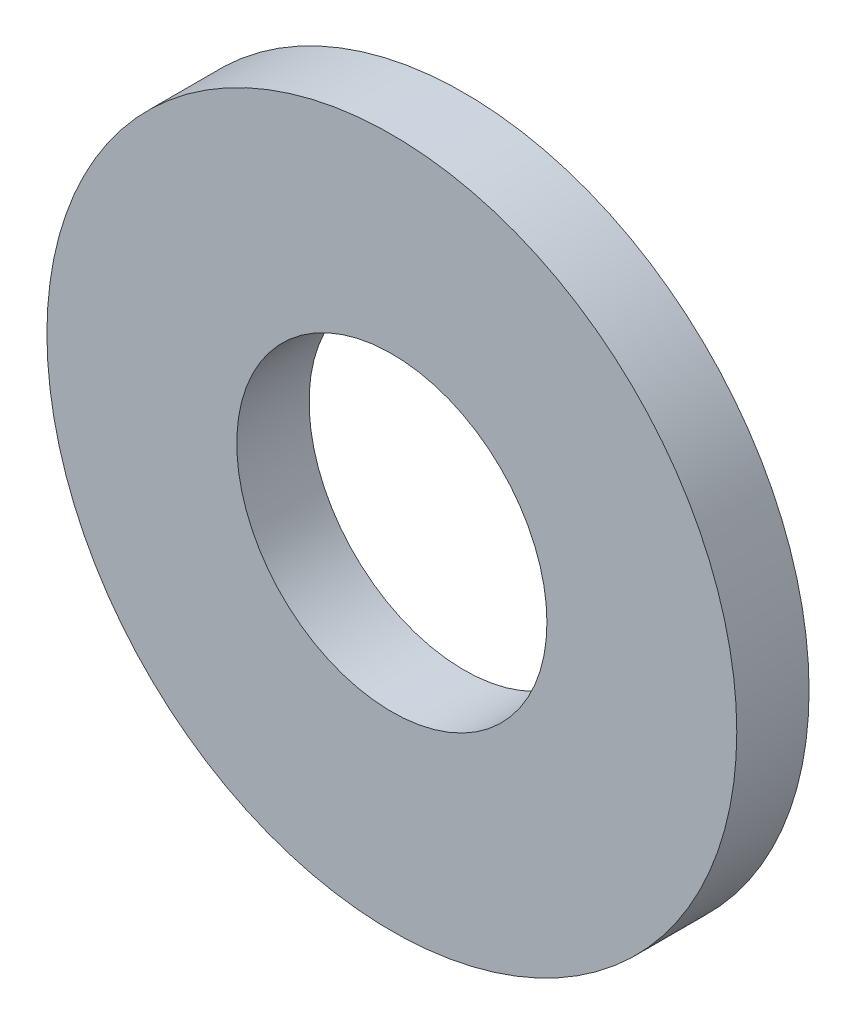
ISO-10303-21;
HEADER;
FILE_DESCRIPTION(('STEP AP214'),'2;1');
FILE_NAME('part.step','',(''),(''),'','','');
FILE_SCHEMA(('AUTOMOTIVE_DESIGN { 1 0 10303 214 1 1 1 1 }'));
ENDSEC;
DATA;
#1=APPLICATION_CONTEXT('core data for automotive mechanical design processes');
#2=APPLICATION_PROTOCOL_DEFINITION('international standard','automotive_design',2000,#1);
#3=PRODUCT_CONTEXT('',#1,'mechanical');
#4=PRODUCT('Part','Part','',(#3));
#5=PRODUCT_RELATED_PRODUCT_CATEGORY('part','',(#4));
#6=PRODUCT_DEFINITION_FORMATION('','',#4);
#7=PRODUCT_DEFINITION_CONTEXT('part definition',#1,'design');
#8=PRODUCT_DEFINITION('design','',#6,#7);
#9=PRODUCT_DEFINITION_SHAPE('','',#8);
#10=(LENGTH_UNIT() NAMED_UNIT(*) SI_UNIT(.MILLI.,.METRE.));
#11=(NAMED_UNIT(*) PLANE_ANGLE_UNIT() SI_UNIT($,.RADIAN.));
#12=(NAMED_UNIT(*) SI_UNIT($,.STERADIAN.) SOLID_ANGLE_UNIT());
#13=UNCERTAINTY_MEASURE_WITH_UNIT(LENGTH_MEASURE(1.E-05),#10,'distance_accuracy_value','');
#14=(GEOMETRIC_REPRESENTATION_CONTEXT(3) GLOBAL_UNCERTAINTY_ASSIGNED_CONTEXT((#13)) GLOBAL_UNIT_ASSIGNED_CONTEXT((#10,
#11,#12)) REPRESENTATION_CONTEXT('',''));
#15=CARTESIAN_POINT('',(0.,0.,0.));
#16=DIRECTION('',(0.,0.,1.));
#17=DIRECTION('',(1.,0.,0.));
#18=AXIS2_PLACEMENT_3D('',#15,#16,#17);
#19=CARTESIAN_POINT('',(0.,0.,0.83185));
#20=DIRECTION('',(0.,0.,1.));
#21=DIRECTION('',(1.,0.,0.));
#22=AXIS2_PLACEMENT_3D('',#19,#20,#21);
#23=PLANE('',#22);
#24=CARTESIAN_POINT('',(0.,0.,0.83185));
#25=DIRECTION('',(0.,0.,1.));
#26=DIRECTION('',(1.,0.,0.));
#27=AXIS2_PLACEMENT_3D('',#24,#25,#26);
#28=CIRCLE('',#27,7.9375);
#29=CARTESIAN_POINT('',(7.9375,0.,0.83185));
#30=VERTEX_POINT('',#29);
#31=EDGE_CURVE('E10',#30,#30,#28,.T.);
#32=ORIENTED_EDGE('',*,*,#31,.T.);
#33=EDGE_LOOP('',(#32));
#34=FACE_BOUND('',#33,.T.);
#35=CARTESIAN_POINT('',(0.,0.,0.83185));
#36=DIRECTION('',(0.,0.,1.));
#37=DIRECTION('',(1.,0.,0.));
#38=AXIS2_PLACEMENT_3D('',#35,#36,#37);
#39=CIRCLE('',#38,3.5687);
#40=CARTESIAN_POINT('',(3.5687,0.,0.83185));
#41=VERTEX_POINT('',#40);
#42=EDGE_CURVE('E47',#41,#41,#39,.T.);
#43=ORIENTED_EDGE('',*,*,#42,.F.);
#44=EDGE_LOOP('',(#43));
#45=FACE_BOUND('',#44,.T.);
#46=ADVANCED_FACE('F41',(#34,#45),#23,.T.);
#47=CARTESIAN_POINT('',(0.,0.,0.83185));
#48=DIRECTION('',(0.,0.,-1.));
#49=DIRECTION('',(-1.,0.,0.));
#50=AXIS2_PLACEMENT_3D('',#47,#48,#49);
#51=CYLINDRICAL_SURFACE('',#50,7.9375);
#52=ORIENTED_EDGE('',*,*,#31,.F.);
#53=EDGE_LOOP('',(#52));
#54=FACE_BOUND('',#53,.T.);
#55=CARTESIAN_POINT('',(0.,0.,-0.831850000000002));
#56=DIRECTION('',(0.,0.,1.));
#57=DIRECTION('',(1.,0.,0.));
#58=AXIS2_PLACEMENT_3D('',#55,#56,#57);
#59=CIRCLE('',#58,7.9375);
#60=CARTESIAN_POINT('',(7.9375,0.,-0.831850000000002));
#61=VERTEX_POINT('',#60);
#62=EDGE_CURVE('E54',#61,#61,#59,.T.);
#63=ORIENTED_EDGE('',*,*,#62,.T.);
#64=EDGE_LOOP('',(#63));
#65=FACE_BOUND('',#64,.T.);
#66=ADVANCED_FACE('F43',(#54,#65),#51,.T.);
#67=CARTESIAN_POINT('',(0.,0.,0.83185));
#68=DIRECTION('',(0.,0.,-1.));
#69=DIRECTION('',(-1.,0.,0.));
#70=AXIS2_PLACEMENT_3D('',#67,#68,#69);
#71=CYLINDRICAL_SURFACE('',#70,3.5687);
#72=ORIENTED_EDGE('',*,*,#42,.T.);
#73=EDGE_LOOP('',(#72));
#74=FACE_BOUND('',#73,.T.);
#75=CARTESIAN_POINT('',(0.,0.,-0.831850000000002));
#76=DIRECTION('',(0.,0.,1.));
#77=DIRECTION('',(1.,0.,0.));
#78=AXIS2_PLACEMENT_3D('',#75,#76,#77);
#79=CIRCLE('',#78,3.5687);
#80=CARTESIAN_POINT('',(3.5687,0.,-0.831850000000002));
#81=VERTEX_POINT('',#80);
#82=EDGE_CURVE('E62',#81,#81,#79,.T.);
#83=ORIENTED_EDGE('',*,*,#82,.F.);
#84=EDGE_LOOP('',(#83));
#85=FACE_BOUND('',#84,.T.);
#86=ADVANCED_FACE('F75',(#74,#85),#71,.F.);
#87=CARTESIAN_POINT('',(0.,0.,-0.831850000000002));
#88=DIRECTION('',(0.,0.,1.));
#89=DIRECTION('',(1.,0.,0.));
#90=AXIS2_PLACEMENT_3D('',#87,#88,#89);
#91=PLANE('',#90);
#92=ORIENTED_EDGE('',*,*,#82,.T.);
#93=EDGE_LOOP('',(#92));
#94=FACE_BOUND('',#93,.T.);
#95=ORIENTED_EDGE('',*,*,#62,.F.);
#96=EDGE_LOOP('',(#95));
#97=FACE_BOUND('',#96,.T.);
#98=ADVANCED_FACE('F68',(#94,#97),#91,.F.);
#99=CLOSED_SHELL('',(#46,#66,#86,#98));
#100=MANIFOLD_SOLID_BREP('B2',#99);
#101=ADVANCED_BREP_SHAPE_REPRESENTATION('',(#18,#100),#14);
#102=SHAPE_DEFINITION_REPRESENTATION(#9,#101);
ENDSEC;
END-ISO-10303-21;
